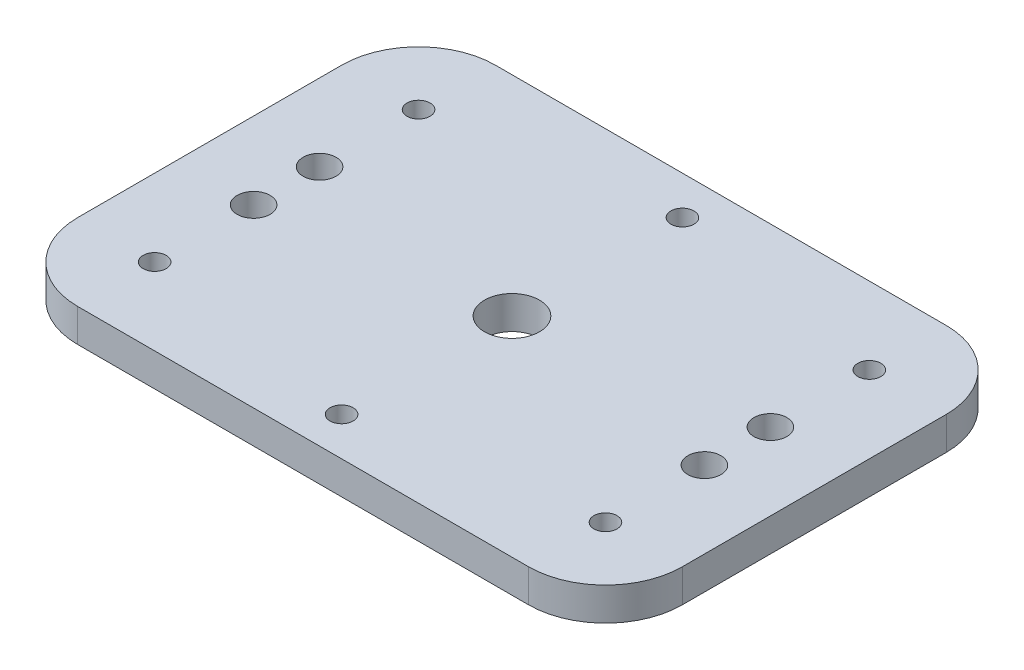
from build123d import *

# Parameters (mm, degrees)
SKETCH1_R         = 5
SKETCH1_R_2       = 3
EXTRUDE1_DEPTH    = 6
M5_TAPPED_HOLE1_D = 4.2


with BuildPart() as part:
    # Sketch1 → Extrude1 (new body)
    with BuildSketch(Plane(origin=(0, 0, 0), x_dir=(1, 0, 0), z_dir=(0, 1, 0))):
        with BuildLine():
            Line((14, 0), (96, 0))
            ThreePointArc((96, 0), (105.899494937, 4.100505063), (110, 14))
            Line((110, 14), (110, 62))
            ThreePointArc((110, 62), (105.899494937, 71.899494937), (96, 76))
            Line((96, 76), (14, 76))
            ThreePointArc((14, 76), (4.100505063, 71.899494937), (0, 62))
            Line((0, 62), (0, 14))
            ThreePointArc((0, 14), (4.100505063, 4.100505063), (14, 0))
        make_face()
        with Locations(Location((55, 38, 0), (0, 0, 270))):
            Circle(SKETCH1_R, mode=Mode.SUBTRACT)
        with Locations(Location((14, 44, 0), (0, 0, 270))):
            Circle(SKETCH1_R_2, mode=Mode.SUBTRACT)
        with Locations(Location((14, 32, 0), (0, 0, 270))):
            Circle(SKETCH1_R_2, mode=Mode.SUBTRACT)
        with Locations(Location((96, 44, 0), (0, 0, 270))):
            Circle(SKETCH1_R_2, mode=Mode.SUBTRACT)
        with Locations(Location((96, 32, 0), (0, 0, 270))):
            Circle(SKETCH1_R_2, mode=Mode.SUBTRACT)
    extrude(amount=EXTRUDE1_DEPTH)

    # M5 Tapped Hole1 (through all)
    with Locations(Plane(origin=(14, 6, -62), x_dir=(0, 0, 1), z_dir=(0, 1, 0))):
        with Locations((0, 0), (-7, 41), (0, 82), (48, 82), (55, 41), (48, 0)):
            Hole(M5_TAPPED_HOLE1_D / 2)


solid = part.part
